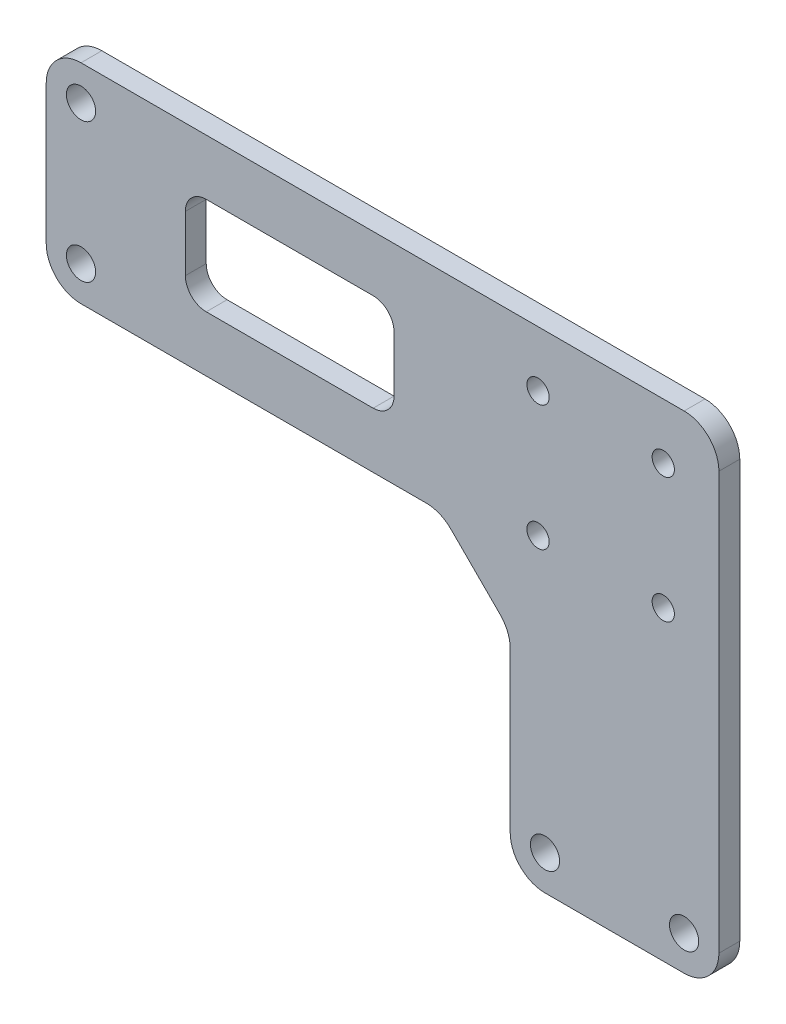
from build123d import *

# Parameters (mm, degrees)
SKETCH_1_R      = 1.6
SKETCH_1_R_2    = 2.1
SKETCH_1_W      = 30
SKETCH_1_H      = 14
EXTRUDE_1_DEPTH = 3
FILLET_1_R      = 5
FILLET_2_R      = 3


with BuildPart() as part:
    # Sketch 1 → Extrude 1 (new body)
    with BuildSketch(Plane.XY):
        Polygon((0, 0), (0, 30), (96.7, 30), (96.7, -40), (66.7, -40), (66.7, -10), (56.7, 0), align=None)
        with Locations((88.7, 22)):
            Circle(SKETCH_1_R, mode=Mode.SUBTRACT)
        with Locations((70.7, 22)):
            Circle(SKETCH_1_R, mode=Mode.SUBTRACT)
        with Locations((70.7, 4)):
            Circle(SKETCH_1_R, mode=Mode.SUBTRACT)
        with Locations((88.7, 4)):
            Circle(SKETCH_1_R, mode=Mode.SUBTRACT)
        with Locations((5, 5)):
            Circle(SKETCH_1_R_2, mode=Mode.SUBTRACT)
        with Locations((5, 25)):
            Circle(SKETCH_1_R_2, mode=Mode.SUBTRACT)
        with Locations((71.7, -35)):
            Circle(SKETCH_1_R_2, mode=Mode.SUBTRACT)
        with Locations((91.7, -35)):
            Circle(SKETCH_1_R_2, mode=Mode.SUBTRACT)
        with Locations((35, 15)):
            Rectangle(SKETCH_1_W, SKETCH_1_H, mode=Mode.SUBTRACT)
    extrude(amount=EXTRUDE_1_DEPTH)

    # Fillet 1
    fillet_1_edges = [part.edges().sort_by_distance(p)[0] for p in [
        (0, 0, 1.5),
        (0, 30, 1.5),
        (96.7, 30, 1.5),
        (96.7, -40, 1.5),
        (66.7, -40, 1.5),
        (66.7, -10, 1.5),
        (56.7, 0, 1.5),
    ]]
    fillet(fillet_1_edges, radius=FILLET_1_R)

    # Fillet 2
    fillet_2_edges = [part.edges().sort_by_distance(p)[0] for p in [
        (50, 8, 1.5),
        (50, 22, 1.5),
        (20, 22, 1.5),
        (20, 8, 1.5),
    ]]
    fillet(fillet_2_edges, radius=FILLET_2_R)


solid = part.part
